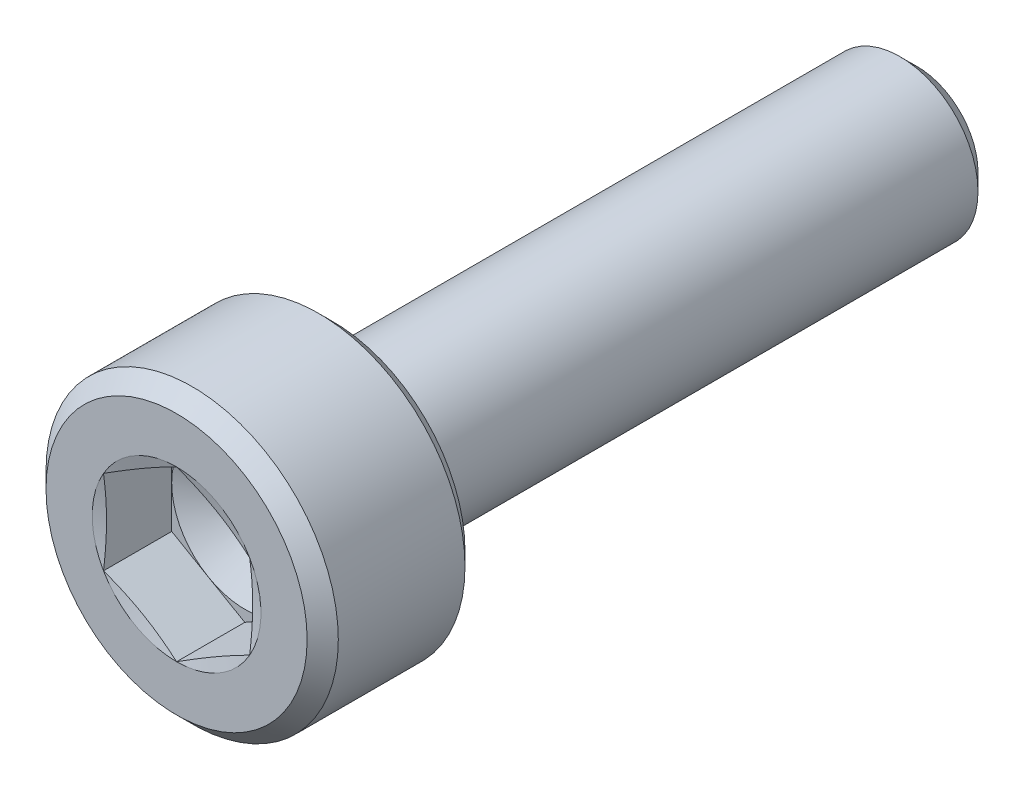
ISO-10303-21;
HEADER;
FILE_DESCRIPTION(('STEP AP214'),'2;1');
FILE_NAME('part.step','',(''),(''),'','','');
FILE_SCHEMA(('AUTOMOTIVE_DESIGN { 1 0 10303 214 1 1 1 1 }'));
ENDSEC;
DATA;
#1=APPLICATION_CONTEXT('core data for automotive mechanical design processes');
#2=APPLICATION_PROTOCOL_DEFINITION('international standard','automotive_design',2000,#1);
#3=PRODUCT_CONTEXT('',#1,'mechanical');
#4=PRODUCT('Part','Part','',(#3));
#5=PRODUCT_RELATED_PRODUCT_CATEGORY('part','',(#4));
#6=PRODUCT_DEFINITION_FORMATION('','',#4);
#7=PRODUCT_DEFINITION_CONTEXT('part definition',#1,'design');
#8=PRODUCT_DEFINITION('design','',#6,#7);
#9=PRODUCT_DEFINITION_SHAPE('','',#8);
#10=(LENGTH_UNIT() NAMED_UNIT(*) SI_UNIT(.MILLI.,.METRE.));
#11=(NAMED_UNIT(*) PLANE_ANGLE_UNIT() SI_UNIT($,.RADIAN.));
#12=(NAMED_UNIT(*) SI_UNIT($,.STERADIAN.) SOLID_ANGLE_UNIT());
#13=UNCERTAINTY_MEASURE_WITH_UNIT(LENGTH_MEASURE(1.E-05),#10,'distance_accuracy_value','');
#14=(GEOMETRIC_REPRESENTATION_CONTEXT(3) GLOBAL_UNCERTAINTY_ASSIGNED_CONTEXT((#13)) GLOBAL_UNIT_ASSIGNED_CONTEXT((#10,
#11,#12)) REPRESENTATION_CONTEXT('',''));
#15=CARTESIAN_POINT('',(0.,0.,0.));
#16=DIRECTION('',(0.,0.,1.));
#17=DIRECTION('',(1.,0.,0.));
#18=AXIS2_PLACEMENT_3D('',#15,#16,#17);
#19=CARTESIAN_POINT('',(0.,0.,0.));
#20=DIRECTION('',(0.,0.,-1.));
#21=DIRECTION('',(-1.,0.,0.));
#22=AXIS2_PLACEMENT_3D('',#19,#20,#21);
#23=PLANE('',#22);
#24=CARTESIAN_POINT('',(0.,0.,0.));
#25=DIRECTION('',(0.,0.,1.));
#26=DIRECTION('',(1.,0.,0.));
#27=AXIS2_PLACEMENT_3D('',#24,#25,#26);
#28=CIRCLE('',#27,1.34);
#29=CARTESIAN_POINT('',(1.34,0.,0.));
#30=VERTEX_POINT('',#29);
#31=EDGE_CURVE('E229',#30,#30,#28,.T.);
#32=ORIENTED_EDGE('',*,*,#31,.T.);
#33=EDGE_LOOP('',(#32));
#34=FACE_BOUND('',#33,.T.);
#35=CARTESIAN_POINT('',(0.,0.,0.));
#36=DIRECTION('',(0.,0.,1.));
#37=DIRECTION('',(1.,0.,0.));
#38=AXIS2_PLACEMENT_3D('',#35,#36,#37);
#39=CIRCLE('',#38,0.866025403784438);
#40=CARTESIAN_POINT('',(-0.75,-0.433012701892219,0.));
#41=VERTEX_POINT('',#40);
#42=CARTESIAN_POINT('',(0.,-0.866025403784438,0.));
#43=VERTEX_POINT('',#42);
#44=EDGE_CURVE('E155',#41,#43,#39,.T.);
#45=ORIENTED_EDGE('',*,*,#44,.F.);
#46=CARTESIAN_POINT('',(-0.75,0.433012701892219,0.));
#47=VERTEX_POINT('',#46);
#48=EDGE_CURVE('E154',#47,#41,#39,.T.);
#49=ORIENTED_EDGE('',*,*,#48,.F.);
#50=CARTESIAN_POINT('',(0.,0.866025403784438,0.));
#51=VERTEX_POINT('',#50);
#52=EDGE_CURVE('E121',#51,#47,#39,.T.);
#53=ORIENTED_EDGE('',*,*,#52,.F.);
#54=CARTESIAN_POINT('',(0.75,0.433012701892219,0.));
#55=VERTEX_POINT('',#54);
#56=EDGE_CURVE('E115',#55,#51,#39,.T.);
#57=ORIENTED_EDGE('',*,*,#56,.F.);
#58=CARTESIAN_POINT('',(0.749999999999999,-0.433012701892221,0.));
#59=VERTEX_POINT('',#58);
#60=EDGE_CURVE('E123',#59,#55,#39,.T.);
#61=ORIENTED_EDGE('',*,*,#60,.F.);
#62=EDGE_CURVE('E313',#43,#59,#39,.T.);
#63=ORIENTED_EDGE('',*,*,#62,.F.);
#64=EDGE_LOOP('',(#45,#49,#53,#57,#61,#63));
#65=FACE_BOUND('',#64,.T.);
#66=ADVANCED_FACE('F38',(#34,#65),#23,.F.);
#67=CARTESIAN_POINT('',(0.,0.,-0.16));
#68=DIRECTION('',(0.,0.,-1.));
#69=DIRECTION('',(-1.,0.,0.));
#70=AXIS2_PLACEMENT_3D('',#67,#68,#69);
#71=CONICAL_SURFACE('',#70,1.5,0.78539816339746);
#72=ORIENTED_EDGE('',*,*,#31,.F.);
#73=EDGE_LOOP('',(#72));
#74=FACE_BOUND('',#73,.T.);
#75=CARTESIAN_POINT('',(0.,0.,-0.16));
#76=DIRECTION('',(0.,0.,1.));
#77=DIRECTION('',(1.,0.,0.));
#78=AXIS2_PLACEMENT_3D('',#75,#76,#77);
#79=CIRCLE('',#78,1.5);
#80=CARTESIAN_POINT('',(1.5,0.,-0.16));
#81=VERTEX_POINT('',#80);
#82=EDGE_CURVE('E231',#81,#81,#79,.T.);
#83=ORIENTED_EDGE('',*,*,#82,.T.);
#84=EDGE_LOOP('',(#83));
#85=FACE_BOUND('',#84,.T.);
#86=ADVANCED_FACE('F220',(#74,#85),#71,.T.);
#87=CARTESIAN_POINT('',(0.,0.,0.));
#88=DIRECTION('',(0.,0.,1.));
#89=DIRECTION('',(1.,0.,0.));
#90=AXIS2_PLACEMENT_3D('',#87,#88,#89);
#91=CYLINDRICAL_SURFACE('',#90,1.5);
#92=ORIENTED_EDGE('',*,*,#82,.F.);
#93=EDGE_LOOP('',(#92));
#94=FACE_BOUND('',#93,.T.);
#95=CARTESIAN_POINT('',(0.,0.,-1.46));
#96=DIRECTION('',(0.,0.,1.));
#97=DIRECTION('',(1.,0.,0.));
#98=AXIS2_PLACEMENT_3D('',#95,#96,#97);
#99=CIRCLE('',#98,1.5);
#100=CARTESIAN_POINT('',(1.5,0.,-1.46));
#101=VERTEX_POINT('',#100);
#102=EDGE_CURVE('E234',#101,#101,#99,.T.);
#103=ORIENTED_EDGE('',*,*,#102,.T.);
#104=EDGE_LOOP('',(#103));
#105=FACE_BOUND('',#104,.T.);
#106=ADVANCED_FACE('F225',(#94,#105),#91,.T.);
#107=CARTESIAN_POINT('',(0.,0.,-1.6));
#108=DIRECTION('',(0.,0.,1.));
#109=DIRECTION('',(1.,0.,0.));
#110=AXIS2_PLACEMENT_3D('',#107,#108,#109);
#111=CONICAL_SURFACE('',#110,1.36,0.785398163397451);
#112=ORIENTED_EDGE('',*,*,#102,.F.);
#113=EDGE_LOOP('',(#112));
#114=FACE_BOUND('',#113,.T.);
#115=CARTESIAN_POINT('',(0.,0.,-1.6));
#116=DIRECTION('',(0.,0.,1.));
#117=DIRECTION('',(1.,0.,0.));
#118=AXIS2_PLACEMENT_3D('',#115,#116,#117);
#119=CIRCLE('',#118,1.36);
#120=CARTESIAN_POINT('',(1.36,0.,-1.6));
#121=VERTEX_POINT('',#120);
#122=EDGE_CURVE('E239',#121,#121,#119,.T.);
#123=ORIENTED_EDGE('',*,*,#122,.T.);
#124=EDGE_LOOP('',(#123));
#125=FACE_BOUND('',#124,.T.);
#126=ADVANCED_FACE('F429',(#114,#125),#111,.T.);
#127=CARTESIAN_POINT('',(0.,1.36,-1.6));
#128=DIRECTION('',(0.,0.,1.));
#129=DIRECTION('',(1.,0.,0.));
#130=AXIS2_PLACEMENT_3D('',#127,#128,#129);
#131=PLANE('',#130);
#132=ORIENTED_EDGE('',*,*,#122,.F.);
#133=EDGE_LOOP('',(#132));
#134=FACE_BOUND('',#133,.T.);
#135=CARTESIAN_POINT('',(0.,0.,-1.6));
#136=DIRECTION('',(0.,0.,1.));
#137=DIRECTION('',(1.,0.,0.));
#138=AXIS2_PLACEMENT_3D('',#135,#136,#137);
#139=CIRCLE('',#138,1.);
#140=CARTESIAN_POINT('',(1.,0.,-1.6));
#141=VERTEX_POINT('',#140);
#142=EDGE_CURVE('E242',#141,#141,#139,.T.);
#143=ORIENTED_EDGE('',*,*,#142,.T.);
#144=EDGE_LOOP('',(#143));
#145=FACE_BOUND('',#144,.T.);
#146=ADVANCED_FACE('F421',(#134,#145),#131,.F.);
#147=CARTESIAN_POINT('',(0.,0.,-1.7));
#148=DIRECTION('',(0.,0.,1.));
#149=DIRECTION('',(1.,0.,0.));
#150=AXIS2_PLACEMENT_3D('',#147,#148,#149);
#151=TOROIDAL_SURFACE('',#150,1.,0.1);
#152=ORIENTED_EDGE('',*,*,#142,.F.);
#153=EDGE_LOOP('',(#152));
#154=FACE_BOUND('',#153,.T.);
#155=CARTESIAN_POINT('',(0.,0.,-1.66153846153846));
#156=DIRECTION('',(0.,0.,1.));
#157=DIRECTION('',(1.,0.,0.));
#158=AXIS2_PLACEMENT_3D('',#155,#156,#157);
#159=CIRCLE('',#158,0.907692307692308);
#160=CARTESIAN_POINT('',(0.907692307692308,0.,-1.66153846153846));
#161=VERTEX_POINT('',#160);
#162=EDGE_CURVE('E245',#161,#161,#159,.T.);
#163=ORIENTED_EDGE('',*,*,#162,.T.);
#164=EDGE_LOOP('',(#163));
#165=FACE_BOUND('',#164,.T.);
#166=ADVANCED_FACE('F413',(#154,#165),#151,.F.);
#167=CARTESIAN_POINT('',(0.,0.,-1.90153846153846));
#168=DIRECTION('',(0.,0.,1.));
#169=DIRECTION('',(1.,0.,0.));
#170=AXIS2_PLACEMENT_3D('',#167,#168,#169);
#171=CONICAL_SURFACE('',#170,0.807692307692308,0.394791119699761);
#172=ORIENTED_EDGE('',*,*,#162,.F.);
#173=EDGE_LOOP('',(#172));
#174=FACE_BOUND('',#173,.T.);
#175=CARTESIAN_POINT('',(0.,0.,-1.90153846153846));
#176=DIRECTION('',(0.,0.,1.));
#177=DIRECTION('',(1.,0.,0.));
#178=AXIS2_PLACEMENT_3D('',#175,#176,#177);
#179=CIRCLE('',#178,0.807692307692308);
#180=CARTESIAN_POINT('',(0.807692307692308,0.,-1.90153846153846));
#181=VERTEX_POINT('',#180);
#182=EDGE_CURVE('E248',#181,#181,#179,.T.);
#183=ORIENTED_EDGE('',*,*,#182,.T.);
#184=EDGE_LOOP('',(#183));
#185=FACE_BOUND('',#184,.T.);
#186=ADVANCED_FACE('F405',(#174,#185),#171,.T.);
#187=CARTESIAN_POINT('',(0.,0.,-1.94));
#188=DIRECTION('',(0.,0.,1.));
#189=DIRECTION('',(1.,0.,0.));
#190=AXIS2_PLACEMENT_3D('',#187,#188,#189);
#191=TOROIDAL_SURFACE('',#190,0.9,0.1);
#192=ORIENTED_EDGE('',*,*,#182,.F.);
#193=EDGE_LOOP('',(#192));
#194=FACE_BOUND('',#193,.T.);
#195=CARTESIAN_POINT('',(0.,0.,-1.94));
#196=DIRECTION('',(0.,0.,1.));
#197=DIRECTION('',(1.,0.,0.));
#198=AXIS2_PLACEMENT_3D('',#195,#196,#197);
#199=CIRCLE('',#198,0.8);
#200=CARTESIAN_POINT('',(0.8,0.,-1.94));
#201=VERTEX_POINT('',#200);
#202=EDGE_CURVE('E251',#201,#201,#199,.T.);
#203=ORIENTED_EDGE('',*,*,#202,.T.);
#204=EDGE_LOOP('',(#203));
#205=FACE_BOUND('',#204,.T.);
#206=ADVANCED_FACE('F397',(#194,#205),#191,.F.);
#207=CARTESIAN_POINT('',(0.,0.,0.));
#208=DIRECTION('',(0.,0.,1.));
#209=DIRECTION('',(1.,0.,0.));
#210=AXIS2_PLACEMENT_3D('',#207,#208,#209);
#211=CYLINDRICAL_SURFACE('',#210,0.8);
#212=ORIENTED_EDGE('',*,*,#202,.F.);
#213=EDGE_LOOP('',(#212));
#214=FACE_BOUND('',#213,.T.);
#215=CARTESIAN_POINT('',(0.,0.,-7.425));
#216=DIRECTION('',(0.,0.,1.));
#217=DIRECTION('',(1.,0.,0.));
#218=AXIS2_PLACEMENT_3D('',#215,#216,#217);
#219=CIRCLE('',#218,0.8);
#220=CARTESIAN_POINT('',(0.8,0.,-7.425));
#221=VERTEX_POINT('',#220);
#222=EDGE_CURVE('E254',#221,#221,#219,.T.);
#223=ORIENTED_EDGE('',*,*,#222,.T.);
#224=EDGE_LOOP('',(#223));
#225=FACE_BOUND('',#224,.T.);
#226=ADVANCED_FACE('F388',(#214,#225),#211,.T.);
#227=CARTESIAN_POINT('',(0.,0.,-7.6));
#228=DIRECTION('',(0.,0.,1.));
#229=DIRECTION('',(1.,0.,0.));
#230=AXIS2_PLACEMENT_3D('',#227,#228,#229);
#231=CONICAL_SURFACE('',#230,0.625,0.785398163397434);
#232=ORIENTED_EDGE('',*,*,#222,.F.);
#233=EDGE_LOOP('',(#232));
#234=FACE_BOUND('',#233,.T.);
#235=CARTESIAN_POINT('',(0.,0.,-7.6));
#236=DIRECTION('',(0.,0.,1.));
#237=DIRECTION('',(1.,0.,0.));
#238=AXIS2_PLACEMENT_3D('',#235,#236,#237);
#239=CIRCLE('',#238,0.625);
#240=CARTESIAN_POINT('',(0.625,0.,-7.6));
#241=VERTEX_POINT('',#240);
#242=EDGE_CURVE('E257',#241,#241,#239,.T.);
#243=ORIENTED_EDGE('',*,*,#242,.T.);
#244=EDGE_LOOP('',(#243));
#245=FACE_BOUND('',#244,.T.);
#246=ADVANCED_FACE('F380',(#234,#245),#231,.T.);
#247=CARTESIAN_POINT('',(0.,0.625,-7.6));
#248=DIRECTION('',(0.,0.,1.));
#249=DIRECTION('',(1.,0.,0.));
#250=AXIS2_PLACEMENT_3D('',#247,#248,#249);
#251=PLANE('',#250);
#252=ORIENTED_EDGE('',*,*,#242,.F.);
#253=EDGE_LOOP('',(#252));
#254=FACE_BOUND('',#253,.T.);
#255=ADVANCED_FACE('F374',(#254),#251,.F.);
#256=CARTESIAN_POINT('',(0.,0.,-0.0310889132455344));
#257=DIRECTION('',(0.,0.,1.));
#258=DIRECTION('',(1.,0.,0.));
#259=AXIS2_PLACEMENT_3D('',#256,#257,#258);
#260=CONICAL_SURFACE('',#259,0.75,1.30899693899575);
#261=ORIENTED_EDGE('',*,*,#52,.T.);
#262=CARTESIAN_POINT('',(-0.7502,0.432897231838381,3.09462948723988E-05));
#263=CARTESIAN_POINT('',(-0.719037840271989,0.450888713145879,-0.00479360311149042));
#264=CARTESIAN_POINT('',(-0.687819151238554,0.468912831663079,-0.00917362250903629));
#265=CARTESIAN_POINT('',(-0.625271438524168,0.505024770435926,-0.0168690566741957));
#266=CARTESIAN_POINT('',(-0.593942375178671,0.523112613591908,-0.0201840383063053));
#267=CARTESIAN_POINT('',(-0.53136401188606,0.559242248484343,-0.0255557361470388));
#268=CARTESIAN_POINT('',(-0.5001151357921,0.577283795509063,-0.0276188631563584));
#269=CARTESIAN_POINT('',(-0.437577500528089,0.613389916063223,-0.0303853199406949));
#270=CARTESIAN_POINT('',(-0.406288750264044,0.631454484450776,-0.0310889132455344));
#271=CARTESIAN_POINT('',(-0.343711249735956,0.667583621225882,-0.0310889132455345));
#272=CARTESIAN_POINT('',(-0.312422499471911,0.685648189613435,-0.0303853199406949));
#273=CARTESIAN_POINT('',(-0.2498848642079,0.721754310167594,-0.0276188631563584));
#274=CARTESIAN_POINT('',(-0.21863598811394,0.739795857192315,-0.0255557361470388));
#275=CARTESIAN_POINT('',(-0.156057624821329,0.77592549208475,-0.0201840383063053));
#276=CARTESIAN_POINT('',(-0.124728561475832,0.794013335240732,-0.0168690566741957));
#277=CARTESIAN_POINT('',(-0.0621808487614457,0.830125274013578,-0.00917362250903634));
#278=CARTESIAN_POINT('',(-0.0309621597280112,0.848149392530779,-0.00479360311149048));
#279=CARTESIAN_POINT('',(0.000200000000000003,0.866140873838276,3.09462948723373E-05));
#280=B_SPLINE_CURVE_WITH_KNOTS('',3,(#262,#263,#264,#265,#266,#267,#268,#269,#270,#271,#272,
#273,#274,#275,#276,#277,#278,#279),.UNSPECIFIED.,.F.,.F.,(4,2,2,2,2,2,2,2,4),(0.,
0.108920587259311,0.217885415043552,0.326287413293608,0.434668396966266,0.543049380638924,
0.651451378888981,0.760416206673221,0.869336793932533),.UNSPECIFIED.);
#281=EDGE_CURVE('E11',#47,#51,#280,.T.);
#282=ORIENTED_EDGE('',*,*,#281,.T.);
#283=EDGE_LOOP('',(#261,#282));
#284=FACE_BOUND('',#283,.T.);
#285=ADVANCED_FACE('F127',(#284),#260,.F.);
#286=CARTESIAN_POINT('',(-0.75,-1.14482258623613,0.13466962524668));
#287=CARTESIAN_POINT('',(-0.75,-1.07678185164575,0.11946091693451));
#288=CARTESIAN_POINT('',(-0.75,-1.00866186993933,0.104564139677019));
#289=CARTESIAN_POINT('',(-0.75,-0.872108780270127,0.0759343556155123));
#290=CARTESIAN_POINT('',(-0.75,-0.803675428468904,0.0622025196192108));
#291=CARTESIAN_POINT('',(-0.75,-0.667024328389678,0.0365778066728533));
#292=CARTESIAN_POINT('',(-0.75,-0.598809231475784,0.0246711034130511));
#293=CARTESIAN_POINT('',(-0.75,-0.461968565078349,0.00349957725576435));
#294=CARTESIAN_POINT('',(-0.75,-0.393343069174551,-0.00576570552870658));
#295=CARTESIAN_POINT('',(-0.75,-0.254874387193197,-0.0204880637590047));
#296=CARTESIAN_POINT('',(-0.75,-0.185026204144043,-0.0259009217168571));
#297=CARTESIAN_POINT('',(-0.75,-0.0451386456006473,-0.0315728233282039));
#298=CARTESIAN_POINT('',(-0.75,0.0249006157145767,-0.0318344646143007));
#299=CARTESIAN_POINT('',(-0.75,0.165046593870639,-0.0271336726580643));
#300=CARTESIAN_POINT('',(-0.75,0.235152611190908,-0.0221520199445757));
#301=CARTESIAN_POINT('',(-0.75,0.374971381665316,-0.00804964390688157));
#302=CARTESIAN_POINT('',(-0.75,0.444683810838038,0.00107409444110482));
#303=CARTESIAN_POINT('',(-0.75,0.57900664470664,0.0214252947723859));
#304=CARTESIAN_POINT('',(-0.75,0.643645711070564,0.0324706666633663));
#305=CARTESIAN_POINT('',(-0.75,0.772626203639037,0.0561976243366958));
#306=CARTESIAN_POINT('',(-0.75,0.836967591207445,0.0688794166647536));
#307=CARTESIAN_POINT('',(-0.75,0.96543538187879,0.0953387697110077));
#308=CARTESIAN_POINT('',(-0.75,1.02956173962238,0.109116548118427));
#309=CARTESIAN_POINT('',(-0.75,1.15764916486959,0.137422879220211));
#310=CARTESIAN_POINT('',(-0.75,1.22161022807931,0.151951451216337));
#311=CARTESIAN_POINT('',(-0.75,1.41205284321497,0.196019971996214));
#312=CARTESIAN_POINT('',(-0.75,1.53835925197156,0.226314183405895));
#313=CARTESIAN_POINT('',(-0.75,1.72754301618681,0.272539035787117));
#314=CARTESIAN_POINT('',(-0.75,1.79052001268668,0.28806821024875));
#315=CARTESIAN_POINT('',(-0.75,1.91641912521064,0.319338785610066));
#316=CARTESIAN_POINT('',(-0.75,1.97934124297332,0.335080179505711));
#317=CARTESIAN_POINT('',(-0.75,2.04224365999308,0.350900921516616));
#318=B_SPLINE_CURVE_WITH_KNOTS('',3,(#286,#287,#288,#289,#290,#291,#292,#293,#294,#295,#296,
#297,#298,#299,#300,#301,#302,#303,#304,#305,#306,#307,#308,#309,#310,#311,#312,#313,#314,#315,
#316,#317),.UNSPECIFIED.,.F.,.F.,(4,2,2,2,2,2,2,2,2,2,2,2,2,2,2,4),(0.,0.209172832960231,
0.418553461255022,0.626259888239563,0.833930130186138,1.04394713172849,1.25385822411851,
1.46454144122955,1.67537826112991,1.87207734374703,2.06880127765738,2.26556438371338,
2.46233255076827,2.85198678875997,3.04657695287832,3.24116071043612),.UNSPECIFIED.);
#319=EDGE_CURVE('E120',#41,#47,#318,.T.);
#320=ORIENTED_EDGE('',*,*,#319,.T.);
#321=ORIENTED_EDGE('',*,*,#48,.T.);
#322=EDGE_LOOP('',(#320,#321));
#323=FACE_BOUND('',#322,.T.);
#324=ADVANCED_FACE('F361',(#323),#260,.F.);
#325=CARTESIAN_POINT('',(0.000199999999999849,-0.866140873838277,3.09462948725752E-05));
#326=CARTESIAN_POINT('',(-0.0309621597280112,-0.84814939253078,-0.00479360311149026));
#327=CARTESIAN_POINT('',(-0.0621808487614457,-0.830125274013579,-0.00917362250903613));
#328=CARTESIAN_POINT('',(-0.124728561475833,-0.794013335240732,-0.0168690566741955));
#329=CARTESIAN_POINT('',(-0.15605762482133,-0.775925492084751,-0.0201840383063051));
#330=CARTESIAN_POINT('',(-0.218635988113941,-0.739795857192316,-0.0255557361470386));
#331=CARTESIAN_POINT('',(-0.2498848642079,-0.721754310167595,-0.0276188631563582));
#332=CARTESIAN_POINT('',(-0.312422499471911,-0.685648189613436,-0.0303853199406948));
#333=CARTESIAN_POINT('',(-0.343711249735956,-0.667583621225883,-0.0310889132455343));
#334=CARTESIAN_POINT('',(-0.406288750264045,-0.631454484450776,-0.0310889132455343));
#335=CARTESIAN_POINT('',(-0.437577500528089,-0.613389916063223,-0.0303853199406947));
#336=CARTESIAN_POINT('',(-0.5001151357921,-0.577283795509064,-0.0276188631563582));
#337=CARTESIAN_POINT('',(-0.53136401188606,-0.559242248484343,-0.0255557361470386));
#338=CARTESIAN_POINT('',(-0.593942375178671,-0.523112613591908,-0.0201840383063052));
#339=CARTESIAN_POINT('',(-0.625271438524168,-0.505024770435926,-0.0168690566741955));
#340=CARTESIAN_POINT('',(-0.687819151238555,-0.46891283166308,-0.00917362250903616));
#341=CARTESIAN_POINT('',(-0.719037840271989,-0.450888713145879,-0.00479360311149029));
#342=CARTESIAN_POINT('',(-0.7502,-0.432897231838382,3.09462948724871E-05));
#343=B_SPLINE_CURVE_WITH_KNOTS('',3,(#325,#326,#327,#328,#329,#330,#331,#332,#333,#334,#335,
#336,#337,#338,#339,#340,#341,#342),.UNSPECIFIED.,.F.,.F.,(4,2,2,2,2,2,2,2,4),(0.,
0.108920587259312,0.217885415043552,0.326287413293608,0.434668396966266,0.543049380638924,
0.651451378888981,0.760416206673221,0.869336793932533),.UNSPECIFIED.);
#344=EDGE_CURVE('E163',#43,#41,#343,.T.);
#345=ORIENTED_EDGE('',*,*,#344,.T.);
#346=ORIENTED_EDGE('',*,*,#44,.T.);
#347=EDGE_LOOP('',(#345,#346));
#348=FACE_BOUND('',#347,.T.);
#349=ADVANCED_FACE('F355',(#348),#260,.F.);
#350=CARTESIAN_POINT('',(0.7502,-0.432897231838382,3.09462948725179E-05));
#351=CARTESIAN_POINT('',(0.719037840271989,-0.45088871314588,-0.00479360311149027));
#352=CARTESIAN_POINT('',(0.687819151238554,-0.46891283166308,-0.00917362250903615));
#353=CARTESIAN_POINT('',(0.625271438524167,-0.505024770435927,-0.0168690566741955));
#354=CARTESIAN_POINT('',(0.59394237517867,-0.523112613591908,-0.0201840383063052));
#355=CARTESIAN_POINT('',(0.531364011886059,-0.559242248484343,-0.0255557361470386));
#356=CARTESIAN_POINT('',(0.5001151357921,-0.577283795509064,-0.0276188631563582));
#357=CARTESIAN_POINT('',(0.437577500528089,-0.613389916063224,-0.0303853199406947));
#358=CARTESIAN_POINT('',(0.406288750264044,-0.631454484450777,-0.0310889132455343));
#359=CARTESIAN_POINT('',(0.343711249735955,-0.667583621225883,-0.0310889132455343));
#360=CARTESIAN_POINT('',(0.312422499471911,-0.685648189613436,-0.0303853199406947));
#361=CARTESIAN_POINT('',(0.2498848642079,-0.721754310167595,-0.0276188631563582));
#362=CARTESIAN_POINT('',(0.21863598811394,-0.739795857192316,-0.0255557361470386));
#363=CARTESIAN_POINT('',(0.156057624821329,-0.775925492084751,-0.0201840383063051));
#364=CARTESIAN_POINT('',(0.124728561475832,-0.794013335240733,-0.0168690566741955));
#365=CARTESIAN_POINT('',(0.0621808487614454,-0.830125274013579,-0.00917362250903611));
#366=CARTESIAN_POINT('',(0.0309621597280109,-0.84814939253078,-0.00479360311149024));
#367=CARTESIAN_POINT('',(-0.000200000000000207,-0.866140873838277,3.09462948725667E-05));
#368=B_SPLINE_CURVE_WITH_KNOTS('',3,(#350,#351,#352,#353,#354,#355,#356,#357,#358,#359,#360,
#361,#362,#363,#364,#365,#366,#367),.UNSPECIFIED.,.F.,.F.,(4,2,2,2,2,2,2,2,4),(0.,
0.108920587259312,0.217885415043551,0.326287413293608,0.434668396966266,0.543049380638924,
0.651451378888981,0.760416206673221,0.869336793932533),.UNSPECIFIED.);
#369=EDGE_CURVE('E183',#59,#43,#368,.T.);
#370=ORIENTED_EDGE('',*,*,#369,.T.);
#371=ORIENTED_EDGE('',*,*,#62,.T.);
#372=EDGE_LOOP('',(#370,#371));
#373=FACE_BOUND('',#372,.T.);
#374=ADVANCED_FACE('F349',(#373),#260,.F.);
#375=CARTESIAN_POINT('',(0.75,-1.14482258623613,0.13466962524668));
#376=CARTESIAN_POINT('',(0.75,-1.07678185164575,0.11946091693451));
#377=CARTESIAN_POINT('',(0.75,-1.00866186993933,0.104564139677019));
#378=CARTESIAN_POINT('',(0.75,-0.872108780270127,0.0759343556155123));
#379=CARTESIAN_POINT('',(0.75,-0.803675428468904,0.0622025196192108));
#380=CARTESIAN_POINT('',(0.75,-0.667024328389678,0.0365778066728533));
#381=CARTESIAN_POINT('',(0.75,-0.598809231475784,0.0246711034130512));
#382=CARTESIAN_POINT('',(0.75,-0.461968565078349,0.00349957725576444));
#383=CARTESIAN_POINT('',(0.75,-0.393343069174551,-0.00576570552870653));
#384=CARTESIAN_POINT('',(0.75,-0.254874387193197,-0.0204880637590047));
#385=CARTESIAN_POINT('',(0.75,-0.185026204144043,-0.025900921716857));
#386=CARTESIAN_POINT('',(0.75,-0.045138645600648,-0.0315728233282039));
#387=CARTESIAN_POINT('',(0.75,0.0249006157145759,-0.0318344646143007));
#388=CARTESIAN_POINT('',(0.75,0.165046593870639,-0.0271336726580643));
#389=CARTESIAN_POINT('',(0.75,0.235152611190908,-0.0221520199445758));
#390=CARTESIAN_POINT('',(0.75,0.374971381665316,-0.00804964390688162));
#391=CARTESIAN_POINT('',(0.75,0.444683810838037,0.00107409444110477));
#392=CARTESIAN_POINT('',(0.75,0.57900664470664,0.0214252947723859));
#393=CARTESIAN_POINT('',(0.75,0.643645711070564,0.0324706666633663));
#394=CARTESIAN_POINT('',(0.75,0.772626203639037,0.0561976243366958));
#395=CARTESIAN_POINT('',(0.75,0.836967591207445,0.0688794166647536));
#396=CARTESIAN_POINT('',(0.75,0.965435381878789,0.0953387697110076));
#397=CARTESIAN_POINT('',(0.75,1.02956173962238,0.109116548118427));
#398=CARTESIAN_POINT('',(0.75,1.15764916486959,0.137422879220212));
#399=CARTESIAN_POINT('',(0.75,1.22161022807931,0.151951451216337));
#400=CARTESIAN_POINT('',(0.75,1.41205284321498,0.196019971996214));
#401=CARTESIAN_POINT('',(0.75,1.53835925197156,0.226314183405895));
#402=CARTESIAN_POINT('',(0.75,1.72754301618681,0.272539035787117));
#403=CARTESIAN_POINT('',(0.75,1.79052001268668,0.28806821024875));
#404=CARTESIAN_POINT('',(0.75,1.91641912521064,0.319338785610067));
#405=CARTESIAN_POINT('',(0.75,1.97934124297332,0.335080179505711));
#406=CARTESIAN_POINT('',(0.75,2.04224365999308,0.350900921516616));
#407=B_SPLINE_CURVE_WITH_KNOTS('',3,(#375,#376,#377,#378,#379,#380,#381,#382,#383,#384,#385,
#386,#387,#388,#389,#390,#391,#392,#393,#394,#395,#396,#397,#398,#399,#400,#401,#402,#403,#404,
#405,#406),.UNSPECIFIED.,.F.,.F.,(4,2,2,2,2,2,2,2,2,2,2,2,2,2,2,4),(0.,0.209172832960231,
0.418553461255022,0.626259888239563,0.833930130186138,1.04394713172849,1.25385822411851,
1.46454144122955,1.67537826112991,1.87207734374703,2.06880127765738,2.26556438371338,
2.46233255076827,2.85198678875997,3.04657695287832,3.24116071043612),.UNSPECIFIED.);
#408=EDGE_CURVE('E63',#55,#59,#407,.F.);
#409=ORIENTED_EDGE('',*,*,#408,.T.);
#410=ORIENTED_EDGE('',*,*,#60,.T.);
#411=EDGE_LOOP('',(#409,#410));
#412=FACE_BOUND('',#411,.T.);
#413=ADVANCED_FACE('F176',(#412),#260,.F.);
#414=CARTESIAN_POINT('',(-0.000199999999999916,0.866140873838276,3.09462948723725E-05));
#415=CARTESIAN_POINT('',(0.0309621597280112,0.848149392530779,-0.00479360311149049));
#416=CARTESIAN_POINT('',(0.0621808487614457,0.830125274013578,-0.00917362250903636));
#417=CARTESIAN_POINT('',(0.124728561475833,0.794013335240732,-0.0168690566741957));
#418=CARTESIAN_POINT('',(0.15605762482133,0.77592549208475,-0.0201840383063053));
#419=CARTESIAN_POINT('',(0.218635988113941,0.739795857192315,-0.0255557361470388));
#420=CARTESIAN_POINT('',(0.2498848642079,0.721754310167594,-0.0276188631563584));
#421=CARTESIAN_POINT('',(0.312422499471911,0.685648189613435,-0.0303853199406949));
#422=CARTESIAN_POINT('',(0.343711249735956,0.667583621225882,-0.0310889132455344));
#423=CARTESIAN_POINT('',(0.406288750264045,0.631454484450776,-0.0310889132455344));
#424=CARTESIAN_POINT('',(0.437577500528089,0.613389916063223,-0.0303853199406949));
#425=CARTESIAN_POINT('',(0.5001151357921,0.577283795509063,-0.0276188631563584));
#426=CARTESIAN_POINT('',(0.53136401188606,0.559242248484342,-0.0255557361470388));
#427=CARTESIAN_POINT('',(0.593942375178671,0.523112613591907,-0.0201840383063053));
#428=CARTESIAN_POINT('',(0.625271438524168,0.505024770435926,-0.0168690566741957));
#429=CARTESIAN_POINT('',(0.687819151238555,0.468912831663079,-0.0091736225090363));
#430=CARTESIAN_POINT('',(0.719037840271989,0.450888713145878,-0.00479360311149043));
#431=CARTESIAN_POINT('',(0.7502,0.432897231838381,3.09462948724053E-05));
#432=B_SPLINE_CURVE_WITH_KNOTS('',3,(#414,#415,#416,#417,#418,#419,#420,#421,#422,#423,#424,
#425,#426,#427,#428,#429,#430,#431),.UNSPECIFIED.,.F.,.F.,(4,2,2,2,2,2,2,2,4),(0.,
0.108920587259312,0.217885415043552,0.326287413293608,0.434668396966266,0.543049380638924,
0.651451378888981,0.760416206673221,0.869336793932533),.UNSPECIFIED.);
#433=EDGE_CURVE('E57',#51,#55,#432,.T.);
#434=ORIENTED_EDGE('',*,*,#433,.T.);
#435=ORIENTED_EDGE('',*,*,#56,.T.);
#436=EDGE_LOOP('',(#434,#435));
#437=FACE_BOUND('',#436,.T.);
#438=ADVANCED_FACE('F116',(#437),#260,.F.);
#439=CARTESIAN_POINT('',(0.,0.,-1.13301270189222));
#440=DIRECTION('',(0.,0.,1.));
#441=DIRECTION('',(1.,0.,0.));
#442=AXIS2_PLACEMENT_3D('',#439,#440,#441);
#443=CONICAL_SURFACE('',#442,0.,1.0471975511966);
#444=CARTESIAN_POINT('',(0.,0.,-0.7));
#445=DIRECTION('',(0.,0.,1.));
#446=DIRECTION('',(1.,0.,0.));
#447=AXIS2_PLACEMENT_3D('',#444,#445,#446);
#448=CIRCLE('',#447,0.75);
#449=CARTESIAN_POINT('',(0.75,0.,-0.7));
#450=VERTEX_POINT('',#449);
#451=CARTESIAN_POINT('',(0.375,0.649519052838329,-0.7));
#452=VERTEX_POINT('',#451);
#453=EDGE_CURVE('E143',#450,#452,#448,.T.);
#454=ORIENTED_EDGE('',*,*,#453,.T.);
#455=CARTESIAN_POINT('',(-0.375,0.649519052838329,-0.7));
#456=VERTEX_POINT('',#455);
#457=EDGE_CURVE('E51',#452,#456,#448,.T.);
#458=ORIENTED_EDGE('',*,*,#457,.T.);
#459=CARTESIAN_POINT('',(-0.75,0.,-0.7));
#460=VERTEX_POINT('',#459);
#461=EDGE_CURVE('E294',#456,#460,#448,.T.);
#462=ORIENTED_EDGE('',*,*,#461,.T.);
#463=CARTESIAN_POINT('',(-0.375,-0.649519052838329,-0.7));
#464=VERTEX_POINT('',#463);
#465=EDGE_CURVE('E296',#460,#464,#448,.T.);
#466=ORIENTED_EDGE('',*,*,#465,.T.);
#467=CARTESIAN_POINT('',(0.375,-0.649519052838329,-0.7));
#468=VERTEX_POINT('',#467);
#469=EDGE_CURVE('E232',#464,#468,#448,.T.);
#470=ORIENTED_EDGE('',*,*,#469,.T.);
#471=EDGE_CURVE('E230',#468,#450,#448,.T.);
#472=ORIENTED_EDGE('',*,*,#471,.T.);
#473=EDGE_LOOP('',(#454,#458,#462,#466,#470,#472));
#474=FACE_BOUND('',#473,.T.);
#475=CARTESIAN_POINT('',(0.,0.,-1.13301270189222));
#476=VERTEX_POINT('',#475);
#477=VERTEX_LOOP('',#476);
#478=FACE_BOUND('',#477,.T.);
#479=ADVANCED_FACE('F175',(#474,#478),#443,.F.);
#480=CARTESIAN_POINT('',(0.,0.,-0.7));
#481=DIRECTION('',(0.,0.,1.));
#482=DIRECTION('',(1.,0.,0.));
#483=AXIS2_PLACEMENT_3D('',#480,#481,#482);
#484=PLANE('',#483);
#485=ORIENTED_EDGE('',*,*,#453,.F.);
#486=DIRECTION('',(0.,1.,0.));
#487=VECTOR('',#486,1.);
#488=CARTESIAN_POINT('',(0.75,-0.43301270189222,-0.7));
#489=LINE('',#488,#487);
#490=CARTESIAN_POINT('',(0.75,0.433012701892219,-0.7));
#491=VERTEX_POINT('',#490);
#492=EDGE_CURVE('E273',#450,#491,#489,.T.);
#493=ORIENTED_EDGE('',*,*,#492,.T.);
#494=DIRECTION('',(-0.866025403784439,0.5,0.));
#495=VECTOR('',#494,1.);
#496=CARTESIAN_POINT('',(0.75,0.433012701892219,-0.7));
#497=LINE('',#496,#495);
#498=EDGE_CURVE('E288',#491,#452,#497,.T.);
#499=ORIENTED_EDGE('',*,*,#498,.T.);
#500=EDGE_LOOP('',(#485,#493,#499));
#501=FACE_BOUND('',#500,.T.);
#502=ADVANCED_FACE('F318',(#501),#484,.T.);
#503=ORIENTED_EDGE('',*,*,#471,.F.);
#504=DIRECTION('',(0.866025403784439,0.5,0.));
#505=VECTOR('',#504,1.);
#506=CARTESIAN_POINT('',(0.,-0.866025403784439,-0.7));
#507=LINE('',#506,#505);
#508=CARTESIAN_POINT('',(0.75,-0.43301270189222,-0.7));
#509=VERTEX_POINT('',#508);
#510=EDGE_CURVE('E277',#468,#509,#507,.T.);
#511=ORIENTED_EDGE('',*,*,#510,.T.);
#512=EDGE_CURVE('E150',#509,#450,#489,.T.);
#513=ORIENTED_EDGE('',*,*,#512,.T.);
#514=EDGE_LOOP('',(#503,#511,#513));
#515=FACE_BOUND('',#514,.T.);
#516=ADVANCED_FACE('F206',(#515),#484,.T.);
#517=ORIENTED_EDGE('',*,*,#469,.F.);
#518=DIRECTION('',(0.866025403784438,-0.5,0.));
#519=VECTOR('',#518,1.);
#520=CARTESIAN_POINT('',(-0.75,-0.43301270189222,-0.7));
#521=LINE('',#520,#519);
#522=CARTESIAN_POINT('',(0.,-0.866025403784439,-0.7));
#523=VERTEX_POINT('',#522);
#524=EDGE_CURVE('E281',#464,#523,#521,.T.);
#525=ORIENTED_EDGE('',*,*,#524,.T.);
#526=EDGE_CURVE('E274',#523,#468,#507,.T.);
#527=ORIENTED_EDGE('',*,*,#526,.T.);
#528=EDGE_LOOP('',(#517,#525,#527));
#529=FACE_BOUND('',#528,.T.);
#530=ADVANCED_FACE('F309',(#529),#484,.T.);
#531=ORIENTED_EDGE('',*,*,#465,.F.);
#532=DIRECTION('',(0.,-1.,0.));
#533=VECTOR('',#532,1.);
#534=CARTESIAN_POINT('',(-0.75,0.433012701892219,-0.7));
#535=LINE('',#534,#533);
#536=CARTESIAN_POINT('',(-0.75,-0.43301270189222,-0.7));
#537=VERTEX_POINT('',#536);
#538=EDGE_CURVE('E285',#460,#537,#535,.T.);
#539=ORIENTED_EDGE('',*,*,#538,.T.);
#540=EDGE_CURVE('E278',#537,#464,#521,.T.);
#541=ORIENTED_EDGE('',*,*,#540,.T.);
#542=EDGE_LOOP('',(#531,#539,#541));
#543=FACE_BOUND('',#542,.T.);
#544=ADVANCED_FACE('F323',(#543),#484,.T.);
#545=ORIENTED_EDGE('',*,*,#457,.F.);
#546=CARTESIAN_POINT('',(0.,0.866025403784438,-0.7));
#547=VERTEX_POINT('',#546);
#548=EDGE_CURVE('E290',#452,#547,#497,.T.);
#549=ORIENTED_EDGE('',*,*,#548,.T.);
#550=DIRECTION('',(-0.866025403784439,-0.5,0.));
#551=VECTOR('',#550,1.);
#552=CARTESIAN_POINT('',(0.,0.866025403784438,-0.7));
#553=LINE('',#552,#551);
#554=EDGE_CURVE('E148',#547,#456,#553,.T.);
#555=ORIENTED_EDGE('',*,*,#554,.T.);
#556=EDGE_LOOP('',(#545,#549,#555));
#557=FACE_BOUND('',#556,.T.);
#558=ADVANCED_FACE('F320',(#557),#484,.T.);
#559=ORIENTED_EDGE('',*,*,#461,.F.);
#560=CARTESIAN_POINT('',(-0.75,0.433012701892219,-0.7));
#561=VERTEX_POINT('',#560);
#562=EDGE_CURVE('E287',#456,#561,#553,.T.);
#563=ORIENTED_EDGE('',*,*,#562,.T.);
#564=EDGE_CURVE('E282',#561,#460,#535,.T.);
#565=ORIENTED_EDGE('',*,*,#564,.T.);
#566=EDGE_LOOP('',(#559,#563,#565));
#567=FACE_BOUND('',#566,.T.);
#568=ADVANCED_FACE('F322',(#567),#484,.T.);
#569=CARTESIAN_POINT('',(0.,0.866025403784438,-0.7));
#570=DIRECTION('',(-0.5,0.866025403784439,0.));
#571=DIRECTION('',(-0.866025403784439,-0.5,0.));
#572=AXIS2_PLACEMENT_3D('',#569,#570,#571);
#573=PLANE('',#572);
#574=ORIENTED_EDGE('',*,*,#281,.F.);
#575=DIRECTION('',(0.,0.,1.));
#576=VECTOR('',#575,1.);
#577=CARTESIAN_POINT('',(-0.75,0.433012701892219,-0.7));
#578=LINE('',#577,#576);
#579=EDGE_CURVE('E149',#561,#47,#578,.T.);
#580=ORIENTED_EDGE('',*,*,#579,.F.);
#581=ORIENTED_EDGE('',*,*,#562,.F.);
#582=ORIENTED_EDGE('',*,*,#554,.F.);
#583=DIRECTION('',(0.,0.,1.));
#584=VECTOR('',#583,1.);
#585=CARTESIAN_POINT('',(0.,0.866025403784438,-0.7));
#586=LINE('',#585,#584);
#587=EDGE_CURVE('E138',#547,#51,#586,.T.);
#588=ORIENTED_EDGE('',*,*,#587,.T.);
#589=EDGE_LOOP('',(#574,#580,#581,#582,#588));
#590=FACE_BOUND('',#589,.T.);
#591=ADVANCED_FACE('F145',(#590),#573,.F.);
#592=CARTESIAN_POINT('',(-0.75,0.433012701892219,-0.7));
#593=DIRECTION('',(-1.,0.,0.));
#594=DIRECTION('',(0.,0.,1.));
#595=AXIS2_PLACEMENT_3D('',#592,#593,#594);
#596=PLANE('',#595);
#597=ORIENTED_EDGE('',*,*,#319,.F.);
#598=DIRECTION('',(0.,0.,1.));
#599=VECTOR('',#598,1.);
#600=CARTESIAN_POINT('',(-0.75,-0.43301270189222,-0.7));
#601=LINE('',#600,#599);
#602=EDGE_CURVE('E261',#537,#41,#601,.T.);
#603=ORIENTED_EDGE('',*,*,#602,.F.);
#604=ORIENTED_EDGE('',*,*,#538,.F.);
#605=ORIENTED_EDGE('',*,*,#564,.F.);
#606=ORIENTED_EDGE('',*,*,#579,.T.);
#607=EDGE_LOOP('',(#597,#603,#604,#605,#606));
#608=FACE_BOUND('',#607,.T.);
#609=ADVANCED_FACE('F170',(#608),#596,.F.);
#610=CARTESIAN_POINT('',(-0.75,-0.43301270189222,-0.7));
#611=DIRECTION('',(-0.5,-0.866025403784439,0.));
#612=DIRECTION('',(0.866025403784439,-0.5,0.));
#613=AXIS2_PLACEMENT_3D('',#610,#611,#612);
#614=PLANE('',#613);
#615=ORIENTED_EDGE('',*,*,#344,.F.);
#616=DIRECTION('',(0.,0.,1.));
#617=VECTOR('',#616,1.);
#618=CARTESIAN_POINT('',(0.,-0.866025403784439,-0.7));
#619=LINE('',#618,#617);
#620=EDGE_CURVE('E264',#523,#43,#619,.T.);
#621=ORIENTED_EDGE('',*,*,#620,.F.);
#622=ORIENTED_EDGE('',*,*,#524,.F.);
#623=ORIENTED_EDGE('',*,*,#540,.F.);
#624=ORIENTED_EDGE('',*,*,#602,.T.);
#625=EDGE_LOOP('',(#615,#621,#622,#623,#624));
#626=FACE_BOUND('',#625,.T.);
#627=ADVANCED_FACE('F209',(#626),#614,.F.);
#628=CARTESIAN_POINT('',(0.,-0.866025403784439,-0.7));
#629=DIRECTION('',(0.5,-0.866025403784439,0.));
#630=DIRECTION('',(0.866025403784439,0.5,0.));
#631=AXIS2_PLACEMENT_3D('',#628,#629,#630);
#632=PLANE('',#631);
#633=ORIENTED_EDGE('',*,*,#369,.F.);
#634=DIRECTION('',(0.,0.,1.));
#635=VECTOR('',#634,1.);
#636=CARTESIAN_POINT('',(0.75,-0.43301270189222,-0.7));
#637=LINE('',#636,#635);
#638=EDGE_CURVE('E267',#509,#59,#637,.T.);
#639=ORIENTED_EDGE('',*,*,#638,.F.);
#640=ORIENTED_EDGE('',*,*,#510,.F.);
#641=ORIENTED_EDGE('',*,*,#526,.F.);
#642=ORIENTED_EDGE('',*,*,#620,.T.);
#643=EDGE_LOOP('',(#633,#639,#640,#641,#642));
#644=FACE_BOUND('',#643,.T.);
#645=ADVANCED_FACE('F204',(#644),#632,.F.);
#646=CARTESIAN_POINT('',(0.75,-0.43301270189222,-0.7));
#647=DIRECTION('',(1.,0.,0.));
#648=DIRECTION('',(0.,1.,0.));
#649=AXIS2_PLACEMENT_3D('',#646,#647,#648);
#650=PLANE('',#649);
#651=ORIENTED_EDGE('',*,*,#408,.F.);
#652=DIRECTION('',(0.,0.,1.));
#653=VECTOR('',#652,1.);
#654=CARTESIAN_POINT('',(0.75,0.433012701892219,-0.7));
#655=LINE('',#654,#653);
#656=EDGE_CURVE('E142',#491,#55,#655,.T.);
#657=ORIENTED_EDGE('',*,*,#656,.F.);
#658=ORIENTED_EDGE('',*,*,#492,.F.);
#659=ORIENTED_EDGE('',*,*,#512,.F.);
#660=ORIENTED_EDGE('',*,*,#638,.T.);
#661=EDGE_LOOP('',(#651,#657,#658,#659,#660));
#662=FACE_BOUND('',#661,.T.);
#663=ADVANCED_FACE('F201',(#662),#650,.F.);
#664=CARTESIAN_POINT('',(0.75,0.433012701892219,-0.7));
#665=DIRECTION('',(0.5,0.866025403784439,0.));
#666=DIRECTION('',(-0.866025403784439,0.5,0.));
#667=AXIS2_PLACEMENT_3D('',#664,#665,#666);
#668=PLANE('',#667);
#669=ORIENTED_EDGE('',*,*,#433,.F.);
#670=ORIENTED_EDGE('',*,*,#587,.F.);
#671=ORIENTED_EDGE('',*,*,#548,.F.);
#672=ORIENTED_EDGE('',*,*,#498,.F.);
#673=ORIENTED_EDGE('',*,*,#656,.T.);
#674=EDGE_LOOP('',(#669,#670,#671,#672,#673));
#675=FACE_BOUND('',#674,.T.);
#676=ADVANCED_FACE('F136',(#675),#668,.F.);
#677=CLOSED_SHELL('',(#66,#86,#106,#126,#146,#166,#186,#206,#226,#246,#255,#285,#324,#349,#374,
#413,#438,#479,#502,#516,#530,#544,#558,#568,#591,#609,#627,#645,#663,#676));
#678=MANIFOLD_SOLID_BREP('B2',#677);
#679=ADVANCED_BREP_SHAPE_REPRESENTATION('',(#18,#678),#14);
#680=SHAPE_DEFINITION_REPRESENTATION(#9,#679);
ENDSEC;
END-ISO-10303-21;
